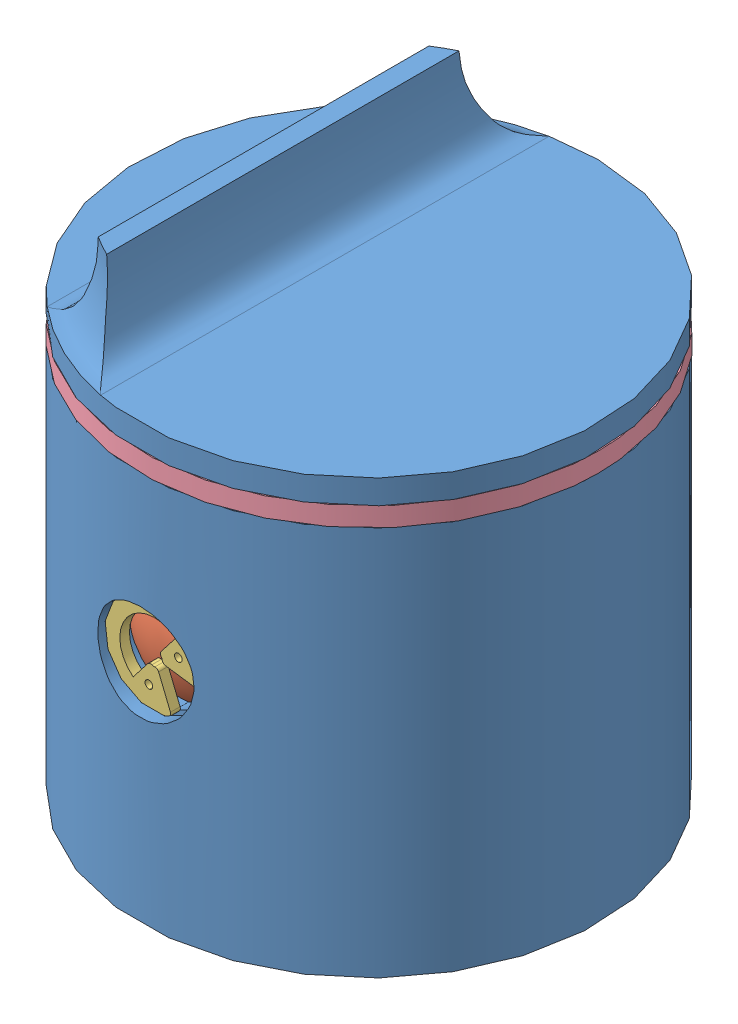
SolidWorks assembly Piston.SLDASM, configuration Default (file format 10000). Lengths in mm.
Overall size (23.76 26.92 23.96).
5 component instances, 4 part files, 8 mates.
Components (placement in the parent):
- Piston-1: Piston.SLDPRT [Défaut] at origin size (23.76 26.92 23.96)
- Axe-1: Axe.SLDPRT [Défaut] at (0 11.75 0) x (0.97735 0.211632 0) z (0 0 1) size (5 5 21.5)
- Anneau élastique-1: Anneau élastique.SLDPRT [Défaut] at (0.079 11.6887 10.75) x (0.613429 0.78975 0) z (0 0 1) size (5 4.61 0.5)
- Anneau élastique-2: Anneau élastique.SLDPRT [Défaut] at (-0.0021 11.65 -11.25) x (0.999785 -0.020747 0) z (0 0 1) size (5 4.61 0.5)
- Segment-1: Segment.SLDPRT [Défaut] at (0 21.25 0) x (1 0 0) z (0 -1 0) size (23.76 23.76 1)
Mates (geometry in assembly coordinates):
- Coaxial1: concentric aligned: cylinder of Piston-1 through (0 11.75 -14.1026) axis (0 0 -1) radius 2.5; cylinder of Axe-1 through (0 11.75 10) axis (0 0 -1) radius 2.5
- Coaxial3: concentric anti-aligned: cylinder of Piston-1 through (0 0 0) axis (0 -1 0) radius 11.88; cylinder of Segment-1 through (0 20.25 0) axis (0 1 0) radius 10.75
- Coïncidente2: coincident anti-aligned: plane of Piston-1 through (-11.88 20.25 0) normal (0 1 0); plane of Segment-1 through (0 20.25 0) normal (0 -1 0)
- Coïncidente3: coincident aligned: plane of Piston-1; plane of Axe-1
- Coaxial4: concentric aligned: cylinder of Piston-1 through (0 11.75 -14.1026) axis (0 0 -1) radius 2.5; cylinder of Anneau élastique-1 through (0 11.75 11.25) axis (0 0 -1) radius 2.5
- Coïncidente4: coincident anti-aligned: plane of Piston-1 through (0 14.25 10.75) normal (0 0 1); plane of Anneau élastique-1 through (0.5923 12.0235 10.75) normal (0 0 -1)
- Coaxial5: concentric aligned: cylinder of Piston-1 through (0 11.75 -14.1026) axis (0 0 -1) radius 2.5; cylinder of Anneau élastique-2 through (0 11.75 -10.75) axis (0 0 -1) radius 2.5
- Coïncidente5: coincident anti-aligned: plane of Piston-1 through (0 14.25 -10.75) normal (0 0 -1); plane of Anneau élastique-2 through (0.573 11.438 -10.75) normal (0 0 1)
